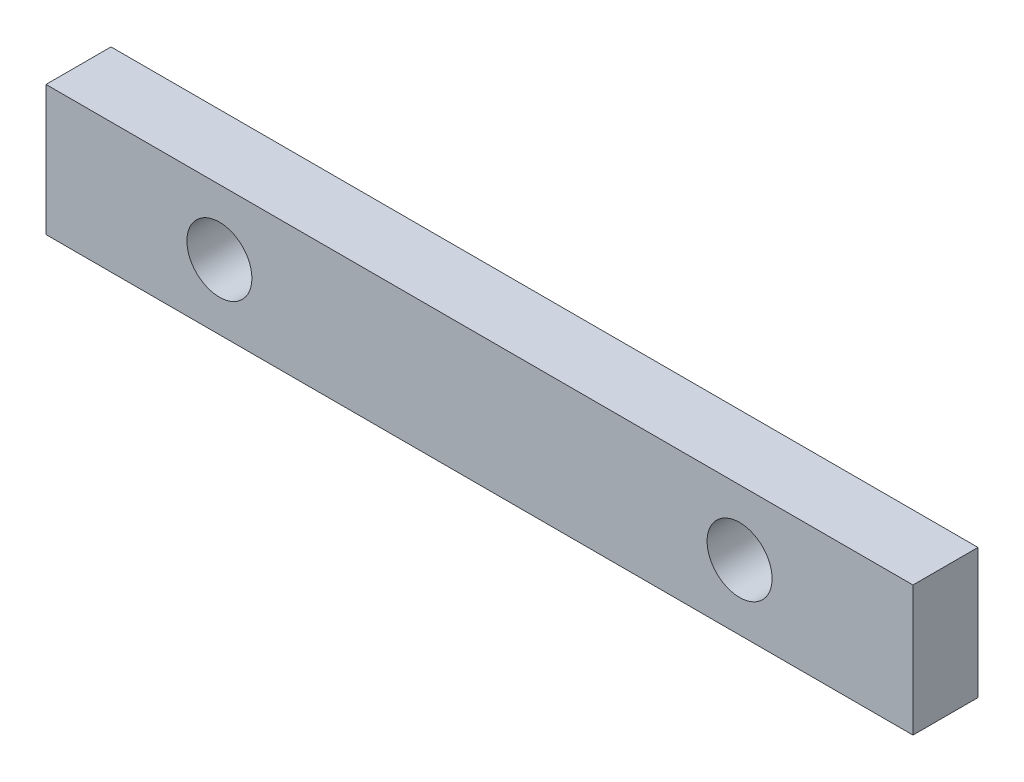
from build123d import *

# Parameters (mm, degrees)
ESQUISSE1_W             = 40
ESQUISSE1_H             = 6
EXTRUSION1_DEPTH        = 3
ESQUISSE2_R             = 1.5
ENL_V_MAT_EXTRU_1_DEPTH = 41.558599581


with BuildPart() as part:
    # Esquisse1 → Extrusion1 (new body)
    with BuildSketch(Plane.XY):
        with Locations((20, 3)):
            Rectangle(ESQUISSE1_W, ESQUISSE1_H)
    extrude(amount=EXTRUSION1_DEPTH)

    # Esquisse2 → Enl_v. mat.-Extru.1 (cut, through all)
    with BuildSketch(Plane.XY.offset(3)):
        with Locations((8, 3)):
            Circle(ESQUISSE2_R)
        with Locations((32, 3)):
            Circle(ESQUISSE2_R)
    extrude(amount=-ENL_V_MAT_EXTRU_1_DEPTH, mode=Mode.SUBTRACT)


solid = part.part
